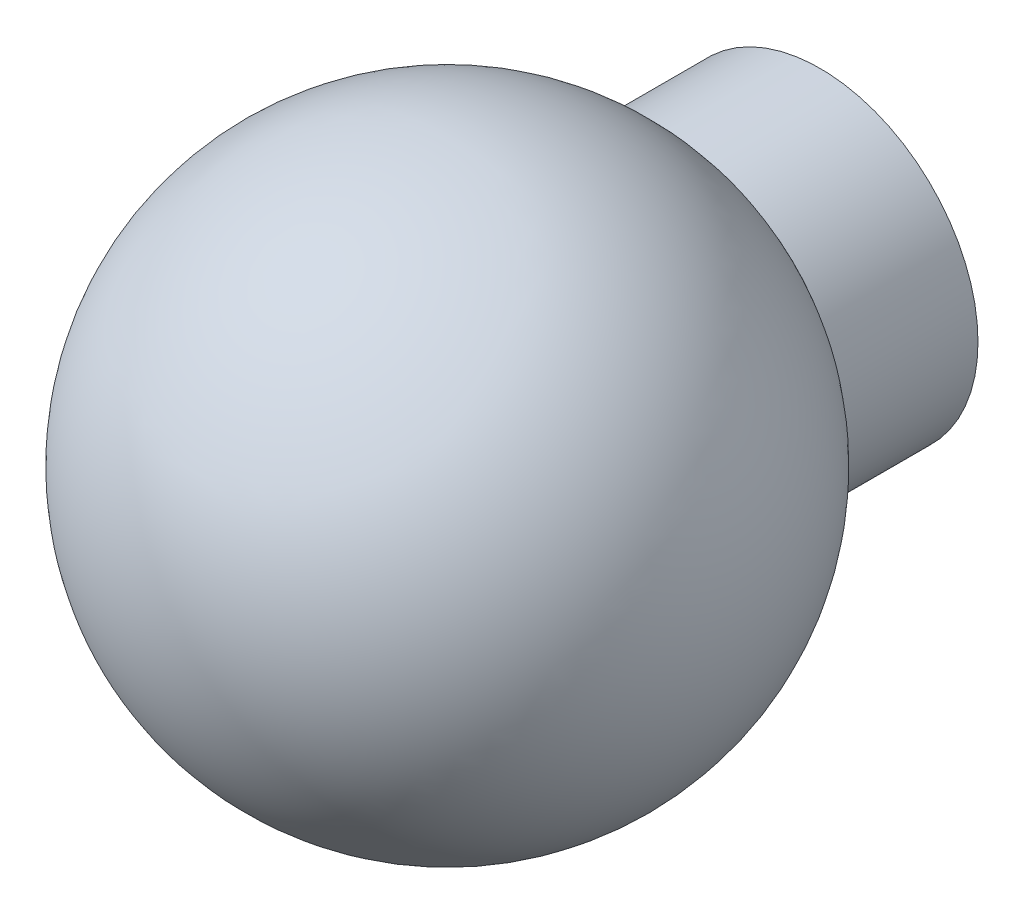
from build123d import *

# Parameters (mm, degrees)
ESQUISSE2_R        = 8
BOSS_EXTRU_2_DEPTH = 18.88


with BuildPart() as part:
    # Esquisse1 → Base-R_volution (revolve)
    with BuildSketch(Plane.XY):
        with BuildLine():
            Line((0, 14.38), (0, -14.38))
            ThreePointArc((0, -14.38), (-14.38, 0), (0, 14.38))
        make_face()
    revolve(axis=Axis((0, 97.818983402, 0), (0, -1, 0)))

    # Esquisse2 → Boss.-Extru.2 (add)
    with BuildSketch(Plane.XY):
        Circle(ESQUISSE2_R)
    extrude(amount=-BOSS_EXTRU_2_DEPTH)


solid = part.part
